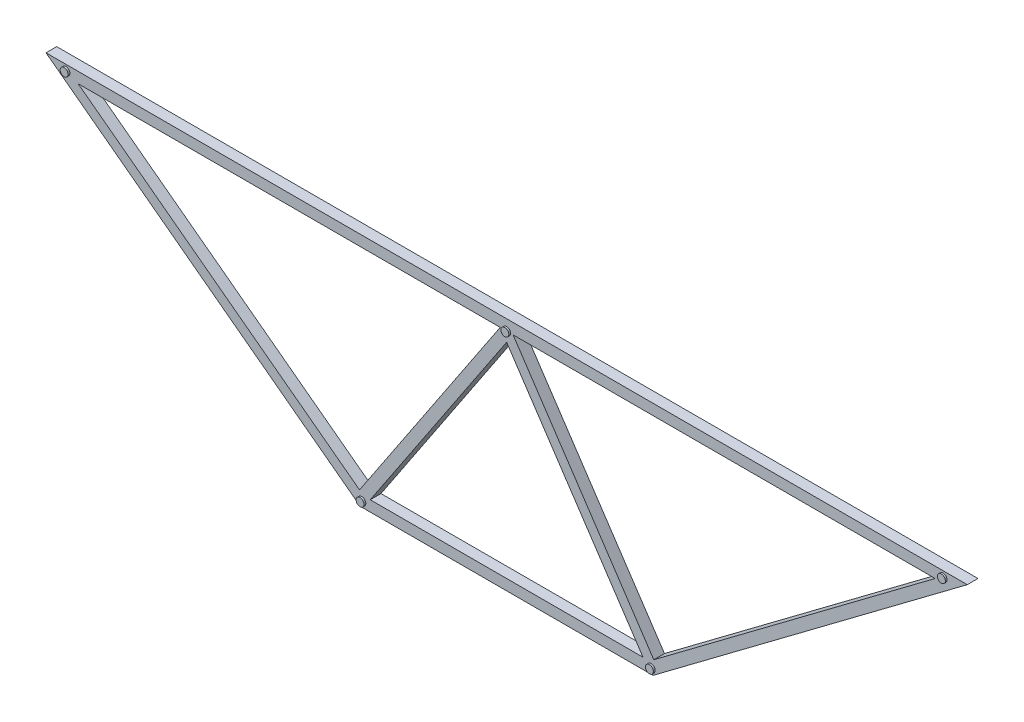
ISO-10303-21;
HEADER;
FILE_DESCRIPTION(('STEP AP214'),'2;1');
FILE_NAME('part.step','',(''),(''),'','','');
FILE_SCHEMA(('AUTOMOTIVE_DESIGN { 1 0 10303 214 1 1 1 1 }'));
ENDSEC;
DATA;
#1=APPLICATION_CONTEXT('core data for automotive mechanical design processes');
#2=APPLICATION_PROTOCOL_DEFINITION('international standard','automotive_design',2000,#1);
#3=PRODUCT_CONTEXT('',#1,'mechanical');
#4=PRODUCT('Part','Part','',(#3));
#5=PRODUCT_RELATED_PRODUCT_CATEGORY('part','',(#4));
#6=PRODUCT_DEFINITION_FORMATION('','',#4);
#7=PRODUCT_DEFINITION_CONTEXT('part definition',#1,'design');
#8=PRODUCT_DEFINITION('design','',#6,#7);
#9=PRODUCT_DEFINITION_SHAPE('','',#8);
#10=(LENGTH_UNIT() NAMED_UNIT(*) SI_UNIT(.MILLI.,.METRE.));
#11=(NAMED_UNIT(*) PLANE_ANGLE_UNIT() SI_UNIT($,.RADIAN.));
#12=(NAMED_UNIT(*) SI_UNIT($,.STERADIAN.) SOLID_ANGLE_UNIT());
#13=UNCERTAINTY_MEASURE_WITH_UNIT(LENGTH_MEASURE(1.E-05),#10,'distance_accuracy_value','');
#14=(GEOMETRIC_REPRESENTATION_CONTEXT(3) GLOBAL_UNCERTAINTY_ASSIGNED_CONTEXT((#13)) GLOBAL_UNIT_ASSIGNED_CONTEXT((#10,
#11,#12)) REPRESENTATION_CONTEXT('',''));
#15=CARTESIAN_POINT('',(0.,0.,0.));
#16=DIRECTION('',(0.,0.,1.));
#17=DIRECTION('',(1.,0.,0.));
#18=AXIS2_PLACEMENT_3D('',#15,#16,#17);
#19=CARTESIAN_POINT('',(600.,0.,17.5));
#20=DIRECTION('',(0.,0.,-1.));
#21=DIRECTION('',(-1.,0.,0.));
#22=AXIS2_PLACEMENT_3D('',#19,#20,#21);
#23=CYLINDRICAL_SURFACE('',#22,5.55499999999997);
#24=CARTESIAN_POINT('',(600.,0.,17.5));
#25=DIRECTION('',(0.,0.,1.));
#26=DIRECTION('',(1.,0.,0.));
#27=AXIS2_PLACEMENT_3D('',#24,#25,#26);
#28=CIRCLE('',#27,5.55499999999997);
#29=CARTESIAN_POINT('',(605.555,0.,17.5));
#30=VERTEX_POINT('',#29);
#31=EDGE_CURVE('E61',#30,#30,#28,.T.);
#32=ORIENTED_EDGE('',*,*,#31,.F.);
#33=EDGE_LOOP('',(#32));
#34=FACE_BOUND('',#33,.T.);
#35=CARTESIAN_POINT('',(600.,0.,-2.5));
#36=DIRECTION('',(0.,0.,1.));
#37=DIRECTION('',(1.,0.,0.));
#38=AXIS2_PLACEMENT_3D('',#35,#36,#37);
#39=CIRCLE('',#38,5.55499999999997);
#40=CARTESIAN_POINT('',(605.555,0.,-2.5));
#41=VERTEX_POINT('',#40);
#42=EDGE_CURVE('E11',#41,#41,#39,.T.);
#43=ORIENTED_EDGE('',*,*,#42,.T.);
#44=EDGE_LOOP('',(#43));
#45=FACE_BOUND('',#44,.T.);
#46=ADVANCED_FACE('F59',(#34,#45),#23,.T.);
#47=CARTESIAN_POINT('',(600.,0.,17.5));
#48=DIRECTION('',(0.,0.,1.));
#49=DIRECTION('',(1.,0.,0.));
#50=AXIS2_PLACEMENT_3D('',#47,#48,#49);
#51=PLANE('',#50);
#52=ORIENTED_EDGE('',*,*,#31,.T.);
#53=EDGE_LOOP('',(#52));
#54=FACE_BOUND('',#53,.T.);
#55=ADVANCED_FACE('F72',(#54),#51,.T.);
#56=CARTESIAN_POINT('',(600.,0.,-2.5));
#57=DIRECTION('',(0.,0.,1.));
#58=DIRECTION('',(1.,0.,0.));
#59=AXIS2_PLACEMENT_3D('',#56,#57,#58);
#60=PLANE('',#59);
#61=ORIENTED_EDGE('',*,*,#42,.F.);
#62=EDGE_LOOP('',(#61));
#63=FACE_BOUND('',#62,.T.);
#64=ADVANCED_FACE('F58',(#63),#60,.F.);
#65=CLOSED_SHELL('',(#46,#55,#64));
#66=MANIFOLD_SOLID_BREP('B2',#65);
#67=CARTESIAN_POINT('',(1211.20734908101,6.71276008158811,17.5));
#68=DIRECTION('',(0.,0.,-1.));
#69=DIRECTION('',(-1.,0.,0.));
#70=AXIS2_PLACEMENT_3D('',#67,#68,#69);
#71=CYLINDRICAL_SURFACE('',#70,5.55499999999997);
#72=CARTESIAN_POINT('',(1211.20734908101,6.71276008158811,17.5));
#73=DIRECTION('',(0.,0.,1.));
#74=DIRECTION('',(1.,0.,0.));
#75=AXIS2_PLACEMENT_3D('',#72,#73,#74);
#76=CIRCLE('',#75,5.55499999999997);
#77=CARTESIAN_POINT('',(1216.76234908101,6.71276008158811,17.5));
#78=VERTEX_POINT('',#77);
#79=EDGE_CURVE('E117',#78,#78,#76,.T.);
#80=ORIENTED_EDGE('',*,*,#79,.F.);
#81=EDGE_LOOP('',(#80));
#82=FACE_BOUND('',#81,.T.);
#83=CARTESIAN_POINT('',(1211.20734908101,6.71276008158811,-2.5));
#84=DIRECTION('',(0.,0.,1.));
#85=DIRECTION('',(1.,0.,0.));
#86=AXIS2_PLACEMENT_3D('',#83,#84,#85);
#87=CIRCLE('',#86,5.55499999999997);
#88=CARTESIAN_POINT('',(1216.76234908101,6.71276008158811,-2.5));
#89=VERTEX_POINT('',#88);
#90=EDGE_CURVE('E60',#89,#89,#87,.T.);
#91=ORIENTED_EDGE('',*,*,#90,.T.);
#92=EDGE_LOOP('',(#91));
#93=FACE_BOUND('',#92,.T.);
#94=ADVANCED_FACE('F108',(#82,#93),#71,.T.);
#95=CARTESIAN_POINT('',(1211.20734908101,6.71276008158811,17.5));
#96=DIRECTION('',(0.,0.,1.));
#97=DIRECTION('',(1.,0.,0.));
#98=AXIS2_PLACEMENT_3D('',#95,#96,#97);
#99=PLANE('',#98);
#100=ORIENTED_EDGE('',*,*,#79,.T.);
#101=EDGE_LOOP('',(#100));
#102=FACE_BOUND('',#101,.T.);
#103=ADVANCED_FACE('F125',(#102),#99,.T.);
#104=CARTESIAN_POINT('',(1211.20734908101,6.71276008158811,-2.5));
#105=DIRECTION('',(0.,0.,1.));
#106=DIRECTION('',(1.,0.,0.));
#107=AXIS2_PLACEMENT_3D('',#104,#105,#106);
#108=PLANE('',#107);
#109=ORIENTED_EDGE('',*,*,#90,.F.);
#110=EDGE_LOOP('',(#109));
#111=FACE_BOUND('',#110,.T.);
#112=ADVANCED_FACE('F112',(#111),#108,.F.);
#113=CLOSED_SHELL('',(#94,#103,#112));
#114=MANIFOLD_SOLID_BREP('B6',#113);
#115=CARTESIAN_POINT('',(802.394900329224,-307.553177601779,17.5));
#116=DIRECTION('',(0.,0.,-1.));
#117=DIRECTION('',(-1.,0.,0.));
#118=AXIS2_PLACEMENT_3D('',#115,#116,#117);
#119=CYLINDRICAL_SURFACE('',#118,5.55499999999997);
#120=CARTESIAN_POINT('',(802.394900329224,-307.553177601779,17.5));
#121=DIRECTION('',(0.,0.,1.));
#122=DIRECTION('',(1.,0.,0.));
#123=AXIS2_PLACEMENT_3D('',#120,#121,#122);
#124=CIRCLE('',#123,5.55499999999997);
#125=CARTESIAN_POINT('',(807.949900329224,-307.553177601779,17.5));
#126=VERTEX_POINT('',#125);
#127=EDGE_CURVE('E170',#126,#126,#124,.T.);
#128=ORIENTED_EDGE('',*,*,#127,.F.);
#129=EDGE_LOOP('',(#128));
#130=FACE_BOUND('',#129,.T.);
#131=CARTESIAN_POINT('',(802.394900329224,-307.553177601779,-2.5));
#132=DIRECTION('',(0.,0.,1.));
#133=DIRECTION('',(1.,0.,0.));
#134=AXIS2_PLACEMENT_3D('',#131,#132,#133);
#135=CIRCLE('',#134,5.55499999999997);
#136=CARTESIAN_POINT('',(807.949900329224,-307.553177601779,-2.5));
#137=VERTEX_POINT('',#136);
#138=EDGE_CURVE('E107',#137,#137,#135,.T.);
#139=ORIENTED_EDGE('',*,*,#138,.T.);
#140=EDGE_LOOP('',(#139));
#141=FACE_BOUND('',#140,.T.);
#142=ADVANCED_FACE('F159',(#130,#141),#119,.T.);
#143=CARTESIAN_POINT('',(802.394900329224,-307.553177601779,17.5));
#144=DIRECTION('',(0.,0.,1.));
#145=DIRECTION('',(1.,0.,0.));
#146=AXIS2_PLACEMENT_3D('',#143,#144,#145);
#147=PLANE('',#146);
#148=ORIENTED_EDGE('',*,*,#127,.T.);
#149=EDGE_LOOP('',(#148));
#150=FACE_BOUND('',#149,.T.);
#151=ADVANCED_FACE('F173',(#150),#147,.T.);
#152=CARTESIAN_POINT('',(802.394900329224,-307.553177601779,-2.5));
#153=DIRECTION('',(0.,0.,1.));
#154=DIRECTION('',(1.,0.,0.));
#155=AXIS2_PLACEMENT_3D('',#152,#153,#154);
#156=PLANE('',#155);
#157=ORIENTED_EDGE('',*,*,#138,.F.);
#158=EDGE_LOOP('',(#157));
#159=FACE_BOUND('',#158,.T.);
#160=ADVANCED_FACE('F165',(#159),#156,.F.);
#161=CLOSED_SHELL('',(#142,#151,#160));
#162=MANIFOLD_SOLID_BREP('B55',#161);
#163=CARTESIAN_POINT('',(397.256799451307,-307.553177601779,17.5));
#164=DIRECTION('',(0.,0.,-1.));
#165=DIRECTION('',(-1.,0.,0.));
#166=AXIS2_PLACEMENT_3D('',#163,#164,#165);
#167=CYLINDRICAL_SURFACE('',#166,5.55499999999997);
#168=CARTESIAN_POINT('',(397.256799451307,-307.553177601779,17.5));
#169=DIRECTION('',(0.,0.,1.));
#170=DIRECTION('',(1.,0.,0.));
#171=AXIS2_PLACEMENT_3D('',#168,#169,#170);
#172=CIRCLE('',#171,5.55499999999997);
#173=CARTESIAN_POINT('',(402.811799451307,-307.553177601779,17.5));
#174=VERTEX_POINT('',#173);
#175=EDGE_CURVE('E217',#174,#174,#172,.T.);
#176=ORIENTED_EDGE('',*,*,#175,.F.);
#177=EDGE_LOOP('',(#176));
#178=FACE_BOUND('',#177,.T.);
#179=CARTESIAN_POINT('',(397.256799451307,-307.553177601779,-2.5));
#180=DIRECTION('',(0.,0.,1.));
#181=DIRECTION('',(1.,0.,0.));
#182=AXIS2_PLACEMENT_3D('',#179,#180,#181);
#183=CIRCLE('',#182,5.55499999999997);
#184=CARTESIAN_POINT('',(402.811799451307,-307.553177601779,-2.5));
#185=VERTEX_POINT('',#184);
#186=EDGE_CURVE('E157',#185,#185,#183,.T.);
#187=ORIENTED_EDGE('',*,*,#186,.T.);
#188=EDGE_LOOP('',(#187));
#189=FACE_BOUND('',#188,.T.);
#190=ADVANCED_FACE('F211',(#178,#189),#167,.T.);
#191=CARTESIAN_POINT('',(397.256799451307,-307.553177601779,17.5));
#192=DIRECTION('',(0.,0.,1.));
#193=DIRECTION('',(1.,0.,0.));
#194=AXIS2_PLACEMENT_3D('',#191,#192,#193);
#195=PLANE('',#194);
#196=ORIENTED_EDGE('',*,*,#175,.T.);
#197=EDGE_LOOP('',(#196));
#198=FACE_BOUND('',#197,.T.);
#199=ADVANCED_FACE('F221',(#198),#195,.T.);
#200=CARTESIAN_POINT('',(397.256799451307,-307.553177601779,-2.5));
#201=DIRECTION('',(0.,0.,1.));
#202=DIRECTION('',(1.,0.,0.));
#203=AXIS2_PLACEMENT_3D('',#200,#201,#202);
#204=PLANE('',#203);
#205=ORIENTED_EDGE('',*,*,#186,.F.);
#206=EDGE_LOOP('',(#205));
#207=FACE_BOUND('',#206,.T.);
#208=ADVANCED_FACE('F213',(#207),#204,.F.);
#209=CLOSED_SHELL('',(#190,#199,#208));
#210=MANIFOLD_SOLID_BREP('B103',#209);
#211=CARTESIAN_POINT('',(-17.1152394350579,6.71276008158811,17.5));
#212=DIRECTION('',(0.,0.,-1.));
#213=DIRECTION('',(-1.,0.,0.));
#214=AXIS2_PLACEMENT_3D('',#211,#212,#213);
#215=CYLINDRICAL_SURFACE('',#214,5.555);
#216=CARTESIAN_POINT('',(-17.1152394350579,6.71276008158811,17.5));
#217=DIRECTION('',(0.,0.,1.));
#218=DIRECTION('',(1.,0.,0.));
#219=AXIS2_PLACEMENT_3D('',#216,#217,#218);
#220=CIRCLE('',#219,5.555);
#221=CARTESIAN_POINT('',(-11.5602394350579,6.71276008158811,17.5));
#222=VERTEX_POINT('',#221);
#223=EDGE_CURVE('E209',#222,#222,#220,.T.);
#224=ORIENTED_EDGE('',*,*,#223,.F.);
#225=EDGE_LOOP('',(#224));
#226=FACE_BOUND('',#225,.T.);
#227=CARTESIAN_POINT('',(-17.1152394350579,6.71276008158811,-2.5));
#228=DIRECTION('',(0.,0.,1.));
#229=DIRECTION('',(1.,0.,0.));
#230=AXIS2_PLACEMENT_3D('',#227,#228,#229);
#231=CIRCLE('',#230,5.555);
#232=CARTESIAN_POINT('',(-11.5602394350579,6.71276008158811,-2.5));
#233=VERTEX_POINT('',#232);
#234=EDGE_CURVE('E267',#233,#233,#231,.T.);
#235=ORIENTED_EDGE('',*,*,#234,.T.);
#236=EDGE_LOOP('',(#235));
#237=FACE_BOUND('',#236,.T.);
#238=ADVANCED_FACE('F263',(#226,#237),#215,.T.);
#239=CARTESIAN_POINT('',(-17.1152394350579,6.71276008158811,17.5));
#240=DIRECTION('',(0.,0.,1.));
#241=DIRECTION('',(1.,0.,0.));
#242=AXIS2_PLACEMENT_3D('',#239,#240,#241);
#243=PLANE('',#242);
#244=ORIENTED_EDGE('',*,*,#223,.T.);
#245=EDGE_LOOP('',(#244));
#246=FACE_BOUND('',#245,.T.);
#247=ADVANCED_FACE('F279',(#246),#243,.T.);
#248=CARTESIAN_POINT('',(-17.1152394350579,6.71276008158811,-2.5));
#249=DIRECTION('',(0.,0.,1.));
#250=DIRECTION('',(1.,0.,0.));
#251=AXIS2_PLACEMENT_3D('',#248,#249,#250);
#252=PLANE('',#251);
#253=ORIENTED_EDGE('',*,*,#234,.F.);
#254=EDGE_LOOP('',(#253));
#255=FACE_BOUND('',#254,.T.);
#256=ADVANCED_FACE('F277',(#255),#252,.F.);
#257=CLOSED_SHELL('',(#238,#247,#256));
#258=MANIFOLD_SOLID_BREP('B152',#257);
#259=CARTESIAN_POINT('',(-9.00000000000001,-12.,15.));
#260=DIRECTION('',(0.6,0.8,0.));
#261=DIRECTION('',(-0.8,0.6,0.));
#262=AXIS2_PLACEMENT_3D('',#259,#260,#261);
#263=PLANE('',#262);
#264=DIRECTION('',(0.8,-0.6,0.));
#265=VECTOR('',#264,1.);
#266=CARTESIAN_POINT('',(-9.00000000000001,-12.,0.));
#267=LINE('',#266,#265);
#268=CARTESIAN_POINT('',(-45.,15.,0.));
#269=VERTEX_POINT('',#268);
#270=CARTESIAN_POINT('',(395.,-315.,0.));
#271=VERTEX_POINT('',#270);
#272=EDGE_CURVE('E460',#269,#271,#267,.T.);
#273=ORIENTED_EDGE('',*,*,#272,.T.);
#274=DIRECTION('',(0.,0.,-1.));
#275=VECTOR('',#274,1.);
#276=CARTESIAN_POINT('',(395.,-315.,15.));
#277=LINE('',#276,#275);
#278=CARTESIAN_POINT('',(395.,-315.,15.));
#279=VERTEX_POINT('',#278);
#280=EDGE_CURVE('E261',#279,#271,#277,.T.);
#281=ORIENTED_EDGE('',*,*,#280,.F.);
#282=DIRECTION('',(0.8,-0.6,0.));
#283=VECTOR('',#282,1.);
#284=CARTESIAN_POINT('',(-9.00000000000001,-12.,15.));
#285=LINE('',#284,#283);
#286=CARTESIAN_POINT('',(-45.,15.,15.));
#287=VERTEX_POINT('',#286);
#288=EDGE_CURVE('E411',#287,#279,#285,.T.);
#289=ORIENTED_EDGE('',*,*,#288,.F.);
#290=DIRECTION('',(0.,0.,-1.));
#291=VECTOR('',#290,1.);
#292=CARTESIAN_POINT('',(-45.,15.,15.));
#293=LINE('',#292,#291);
#294=EDGE_CURVE('E324',#287,#269,#293,.T.);
#295=ORIENTED_EDGE('',*,*,#294,.T.);
#296=EDGE_LOOP('',(#273,#281,#289,#295));
#297=FACE_BOUND('',#296,.T.);
#298=ADVANCED_FACE('F308',(#297),#263,.F.);
#299=CARTESIAN_POINT('',(0.,-315.,15.));
#300=DIRECTION('',(0.,1.,0.));
#301=DIRECTION('',(-1.,0.,0.));
#302=AXIS2_PLACEMENT_3D('',#299,#300,#301);
#303=PLANE('',#302);
#304=DIRECTION('',(1.,0.,0.));
#305=VECTOR('',#304,1.);
#306=CARTESIAN_POINT('',(0.,-315.,0.));
#307=LINE('',#306,#305);
#308=CARTESIAN_POINT('',(805.,-315.,0.));
#309=VERTEX_POINT('',#308);
#310=EDGE_CURVE('E423',#271,#309,#307,.T.);
#311=ORIENTED_EDGE('',*,*,#310,.T.);
#312=DIRECTION('',(0.,0.,-1.));
#313=VECTOR('',#312,1.);
#314=CARTESIAN_POINT('',(805.,-315.,15.));
#315=LINE('',#314,#313);
#316=CARTESIAN_POINT('',(805.,-315.,15.));
#317=VERTEX_POINT('',#316);
#318=EDGE_CURVE('E316',#317,#309,#315,.T.);
#319=ORIENTED_EDGE('',*,*,#318,.F.);
#320=DIRECTION('',(1.,0.,0.));
#321=VECTOR('',#320,1.);
#322=CARTESIAN_POINT('',(0.,-315.,15.));
#323=LINE('',#322,#321);
#324=EDGE_CURVE('E409',#279,#317,#323,.T.);
#325=ORIENTED_EDGE('',*,*,#324,.F.);
#326=ORIENTED_EDGE('',*,*,#280,.T.);
#327=EDGE_LOOP('',(#311,#319,#325,#326));
#328=FACE_BOUND('',#327,.T.);
#329=ADVANCED_FACE('F419',(#328),#303,.F.);
#330=CARTESIAN_POINT('',(441.,-588.,15.));
#331=DIRECTION('',(0.6,-0.8,0.));
#332=DIRECTION('',(0.8,0.6,0.));
#333=AXIS2_PLACEMENT_3D('',#330,#331,#332);
#334=PLANE('',#333);
#335=DIRECTION('',(-0.8,-0.6,0.));
#336=VECTOR('',#335,1.);
#337=CARTESIAN_POINT('',(441.,-588.,0.));
#338=LINE('',#337,#336);
#339=CARTESIAN_POINT('',(1245.,15.,0.));
#340=VERTEX_POINT('',#339);
#341=EDGE_CURVE('E458',#340,#309,#338,.T.);
#342=ORIENTED_EDGE('',*,*,#341,.F.);
#343=DIRECTION('',(0.,0.,-1.));
#344=VECTOR('',#343,1.);
#345=CARTESIAN_POINT('',(1245.,15.,15.));
#346=LINE('',#345,#344);
#347=CARTESIAN_POINT('',(1245.,15.,15.));
#348=VERTEX_POINT('',#347);
#349=EDGE_CURVE('E368',#348,#340,#346,.T.);
#350=ORIENTED_EDGE('',*,*,#349,.F.);
#351=DIRECTION('',(-0.8,-0.6,0.));
#352=VECTOR('',#351,1.);
#353=CARTESIAN_POINT('',(441.,-588.,15.));
#354=LINE('',#353,#352);
#355=EDGE_CURVE('E414',#348,#317,#354,.T.);
#356=ORIENTED_EDGE('',*,*,#355,.T.);
#357=ORIENTED_EDGE('',*,*,#318,.T.);
#358=EDGE_LOOP('',(#342,#350,#356,#357));
#359=FACE_BOUND('',#358,.T.);
#360=ADVANCED_FACE('F422',(#359),#334,.T.);
#361=CARTESIAN_POINT('',(0.,0.,15.));
#362=DIRECTION('',(0.,1.,0.));
#363=DIRECTION('',(0.,0.,1.));
#364=AXIS2_PLACEMENT_3D('',#361,#362,#363);
#365=PLANE('',#364);
#366=DIRECTION('',(1.,0.,0.));
#367=VECTOR('',#366,1.);
#368=CARTESIAN_POINT('',(0.,0.,0.));
#369=LINE('',#368,#367);
#370=CARTESIAN_POINT('',(0.,0.,0.));
#371=VERTEX_POINT('',#370);
#372=CARTESIAN_POINT('',(590.98612181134,0.,0.));
#373=VERTEX_POINT('',#372);
#374=EDGE_CURVE('E438',#371,#373,#369,.T.);
#375=ORIENTED_EDGE('',*,*,#374,.T.);
#376=DIRECTION('',(0.,0.,-1.));
#377=VECTOR('',#376,1.);
#378=CARTESIAN_POINT('',(590.98612181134,0.,15.));
#379=LINE('',#378,#377);
#380=CARTESIAN_POINT('',(590.98612181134,0.,15.));
#381=VERTEX_POINT('',#380);
#382=EDGE_CURVE('E470',#381,#373,#379,.T.);
#383=ORIENTED_EDGE('',*,*,#382,.F.);
#384=DIRECTION('',(1.,0.,0.));
#385=VECTOR('',#384,1.);
#386=CARTESIAN_POINT('',(0.,0.,15.));
#387=LINE('',#386,#385);
#388=CARTESIAN_POINT('',(0.,0.,15.));
#389=VERTEX_POINT('',#388);
#390=EDGE_CURVE('E552',#389,#381,#387,.T.);
#391=ORIENTED_EDGE('',*,*,#390,.F.);
#392=DIRECTION('',(0.,0.,-1.));
#393=VECTOR('',#392,1.);
#394=CARTESIAN_POINT('',(0.,0.,15.));
#395=LINE('',#394,#393);
#396=EDGE_CURVE('E469',#389,#371,#395,.T.);
#397=ORIENTED_EDGE('',*,*,#396,.T.);
#398=EDGE_LOOP('',(#375,#383,#391,#397));
#399=FACE_BOUND('',#398,.T.);
#400=ADVANCED_FACE('F528',(#399),#365,.F.);
#401=CARTESIAN_POINT('',(409.144238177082,-272.762825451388,15.));
#402=DIRECTION('',(0.832050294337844,-0.554700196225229,0.));
#403=DIRECTION('',(0.554700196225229,0.832050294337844,0.));
#404=AXIS2_PLACEMENT_3D('',#401,#402,#403);
#405=PLANE('',#404);
#406=DIRECTION('',(-0.554700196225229,-0.832050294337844,0.));
#407=VECTOR('',#406,1.);
#408=CARTESIAN_POINT('',(409.144238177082,-272.762825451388,0.));
#409=LINE('',#408,#407);
#410=CARTESIAN_POINT('',(393.990747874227,-295.49306090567,0.));
#411=VERTEX_POINT('',#410);
#412=EDGE_CURVE('E452',#373,#411,#409,.T.);
#413=ORIENTED_EDGE('',*,*,#412,.T.);
#414=DIRECTION('',(0.,0.,-1.));
#415=VECTOR('',#414,1.);
#416=CARTESIAN_POINT('',(393.990747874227,-295.49306090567,15.));
#417=LINE('',#416,#415);
#418=CARTESIAN_POINT('',(393.990747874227,-295.49306090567,15.));
#419=VERTEX_POINT('',#418);
#420=EDGE_CURVE('E473',#419,#411,#417,.T.);
#421=ORIENTED_EDGE('',*,*,#420,.F.);
#422=DIRECTION('',(-0.554700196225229,-0.832050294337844,0.));
#423=VECTOR('',#422,1.);
#424=CARTESIAN_POINT('',(409.144238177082,-272.762825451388,15.));
#425=LINE('',#424,#423);
#426=EDGE_CURVE('E560',#381,#419,#425,.T.);
#427=ORIENTED_EDGE('',*,*,#426,.F.);
#428=ORIENTED_EDGE('',*,*,#382,.T.);
#429=EDGE_LOOP('',(#413,#421,#427,#428));
#430=FACE_BOUND('',#429,.T.);
#431=ADVANCED_FACE('F525',(#430),#405,.F.);
#432=CARTESIAN_POINT('',(0.,-300.,15.));
#433=DIRECTION('',(0.,1.,0.));
#434=DIRECTION('',(0.,0.,1.));
#435=AXIS2_PLACEMENT_3D('',#432,#433,#434);
#436=PLANE('',#435);
#437=DIRECTION('',(1.,0.,0.));
#438=VECTOR('',#437,1.);
#439=CARTESIAN_POINT('',(0.,-300.,0.));
#440=LINE('',#439,#438);
#441=CARTESIAN_POINT('',(409.01387818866,-300.,0.));
#442=VERTEX_POINT('',#441);
#443=CARTESIAN_POINT('',(790.98612181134,-300.,0.));
#444=VERTEX_POINT('',#443);
#445=EDGE_CURVE('E445',#442,#444,#440,.T.);
#446=ORIENTED_EDGE('',*,*,#445,.F.);
#447=DIRECTION('',(0.,0.,-1.));
#448=VECTOR('',#447,1.);
#449=CARTESIAN_POINT('',(409.01387818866,-300.,15.));
#450=LINE('',#449,#448);
#451=CARTESIAN_POINT('',(409.01387818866,-300.,15.));
#452=VERTEX_POINT('',#451);
#453=EDGE_CURVE('E472',#452,#442,#450,.T.);
#454=ORIENTED_EDGE('',*,*,#453,.F.);
#455=DIRECTION('',(1.,0.,0.));
#456=VECTOR('',#455,1.);
#457=CARTESIAN_POINT('',(0.,-300.,15.));
#458=LINE('',#457,#456);
#459=CARTESIAN_POINT('',(790.98612181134,-300.,15.));
#460=VERTEX_POINT('',#459);
#461=EDGE_CURVE('E548',#452,#460,#458,.T.);
#462=ORIENTED_EDGE('',*,*,#461,.T.);
#463=DIRECTION('',(0.,0.,-1.));
#464=VECTOR('',#463,1.);
#465=CARTESIAN_POINT('',(790.98612181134,-300.,15.));
#466=LINE('',#465,#464);
#467=EDGE_CURVE('E478',#460,#444,#466,.T.);
#468=ORIENTED_EDGE('',*,*,#467,.T.);
#469=EDGE_LOOP('',(#446,#454,#462,#468));
#470=FACE_BOUND('',#469,.T.);
#471=ADVANCED_FACE('F521',(#470),#436,.T.);
#472=CARTESIAN_POINT('',(421.624992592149,-281.083328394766,15.));
#473=DIRECTION('',(0.832050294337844,-0.554700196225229,0.));
#474=DIRECTION('',(0.554700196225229,0.832050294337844,0.));
#475=AXIS2_PLACEMENT_3D('',#472,#473,#474);
#476=PLANE('',#475);
#477=DIRECTION('',(-0.554700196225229,-0.832050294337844,0.));
#478=VECTOR('',#477,1.);
#479=CARTESIAN_POINT('',(421.624992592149,-281.083328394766,0.));
#480=LINE('',#479,#478);
#481=CARTESIAN_POINT('',(600.,-13.5208172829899,0.));
#482=VERTEX_POINT('',#481);
#483=EDGE_CURVE('E443',#482,#442,#480,.T.);
#484=ORIENTED_EDGE('',*,*,#483,.F.);
#485=DIRECTION('',(0.,0.,-1.));
#486=VECTOR('',#485,1.);
#487=CARTESIAN_POINT('',(600.,-13.5208172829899,15.));
#488=LINE('',#487,#486);
#489=CARTESIAN_POINT('',(600.,-13.5208172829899,15.));
#490=VERTEX_POINT('',#489);
#491=EDGE_CURVE('E476',#490,#482,#488,.T.);
#492=ORIENTED_EDGE('',*,*,#491,.F.);
#493=DIRECTION('',(-0.554700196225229,-0.832050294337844,0.));
#494=VECTOR('',#493,1.);
#495=CARTESIAN_POINT('',(421.624992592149,-281.083328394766,15.));
#496=LINE('',#495,#494);
#497=EDGE_CURVE('E546',#490,#452,#496,.T.);
#498=ORIENTED_EDGE('',*,*,#497,.T.);
#499=ORIENTED_EDGE('',*,*,#453,.T.);
#500=EDGE_LOOP('',(#484,#492,#498,#499));
#501=FACE_BOUND('',#500,.T.);
#502=ADVANCED_FACE('F529',(#501),#476,.T.);
#503=CARTESIAN_POINT('',(421.624992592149,281.083328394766,15.));
#504=DIRECTION('',(0.832050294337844,0.554700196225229,0.));
#505=DIRECTION('',(-0.554700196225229,0.832050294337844,0.));
#506=AXIS2_PLACEMENT_3D('',#503,#504,#505);
#507=PLANE('',#506);
#508=DIRECTION('',(0.554700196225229,-0.832050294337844,0.));
#509=VECTOR('',#508,1.);
#510=CARTESIAN_POINT('',(421.624992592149,281.083328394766,0.));
#511=LINE('',#510,#509);
#512=CARTESIAN_POINT('',(609.01387818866,0.,0.));
#513=VERTEX_POINT('',#512);
#514=CARTESIAN_POINT('',(806.009252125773,-295.49306090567,0.));
#515=VERTEX_POINT('',#514);
#516=EDGE_CURVE('E435',#513,#515,#511,.T.);
#517=ORIENTED_EDGE('',*,*,#516,.F.);
#518=DIRECTION('',(0.,0.,-1.));
#519=VECTOR('',#518,1.);
#520=CARTESIAN_POINT('',(609.01387818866,0.,15.));
#521=LINE('',#520,#519);
#522=CARTESIAN_POINT('',(609.01387818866,0.,15.));
#523=VERTEX_POINT('',#522);
#524=EDGE_CURVE('E309',#523,#513,#521,.T.);
#525=ORIENTED_EDGE('',*,*,#524,.F.);
#526=DIRECTION('',(0.554700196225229,-0.832050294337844,0.));
#527=VECTOR('',#526,1.);
#528=CARTESIAN_POINT('',(421.624992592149,281.083328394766,15.));
#529=LINE('',#528,#527);
#530=CARTESIAN_POINT('',(806.009252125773,-295.49306090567,15.));
#531=VERTEX_POINT('',#530);
#532=EDGE_CURVE('E461',#523,#531,#529,.T.);
#533=ORIENTED_EDGE('',*,*,#532,.T.);
#534=DIRECTION('',(0.,0.,-1.));
#535=VECTOR('',#534,1.);
#536=CARTESIAN_POINT('',(806.009252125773,-295.49306090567,15.));
#537=LINE('',#536,#535);
#538=EDGE_CURVE('E428',#531,#515,#537,.T.);
#539=ORIENTED_EDGE('',*,*,#538,.T.);
#540=EDGE_LOOP('',(#517,#525,#533,#539));
#541=FACE_BOUND('',#540,.T.);
#542=ADVANCED_FACE('F306',(#541),#507,.T.);
#543=CARTESIAN_POINT('',(1200.,0.,0.));
#544=VERTEX_POINT('',#543);
#545=EDGE_CURVE('E434',#513,#544,#369,.T.);
#546=ORIENTED_EDGE('',*,*,#545,.T.);
#547=DIRECTION('',(0.,0.,-1.));
#548=VECTOR('',#547,1.);
#549=CARTESIAN_POINT('',(1200.,0.,15.));
#550=LINE('',#549,#548);
#551=CARTESIAN_POINT('',(1200.,0.,15.));
#552=VERTEX_POINT('',#551);
#553=EDGE_CURVE('E481',#552,#544,#550,.T.);
#554=ORIENTED_EDGE('',*,*,#553,.F.);
#555=EDGE_CURVE('E489',#523,#552,#387,.T.);
#556=ORIENTED_EDGE('',*,*,#555,.F.);
#557=ORIENTED_EDGE('',*,*,#524,.T.);
#558=EDGE_LOOP('',(#546,#554,#556,#557));
#559=FACE_BOUND('',#558,.T.);
#560=ADVANCED_FACE('F487',(#559),#365,.F.);
#561=CARTESIAN_POINT('',(0.,0.,15.));
#562=DIRECTION('',(0.6,0.8,0.));
#563=DIRECTION('',(-0.8,0.6,0.));
#564=AXIS2_PLACEMENT_3D('',#561,#562,#563);
#565=PLANE('',#564);
#566=DIRECTION('',(0.8,-0.6,0.));
#567=VECTOR('',#566,1.);
#568=CARTESIAN_POINT('',(0.,0.,0.));
#569=LINE('',#568,#567);
#570=EDGE_CURVE('E454',#371,#411,#569,.T.);
#571=ORIENTED_EDGE('',*,*,#570,.F.);
#572=ORIENTED_EDGE('',*,*,#396,.F.);
#573=DIRECTION('',(0.8,-0.6,0.));
#574=VECTOR('',#573,1.);
#575=CARTESIAN_POINT('',(0.,0.,15.));
#576=LINE('',#575,#574);
#577=EDGE_CURVE('E559',#389,#419,#576,.T.);
#578=ORIENTED_EDGE('',*,*,#577,.T.);
#579=ORIENTED_EDGE('',*,*,#420,.T.);
#580=EDGE_LOOP('',(#571,#572,#578,#579));
#581=FACE_BOUND('',#580,.T.);
#582=ADVANCED_FACE('F510',(#581),#565,.T.);
#583=CARTESIAN_POINT('',(409.144238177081,272.762825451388,15.));
#584=DIRECTION('',(0.832050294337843,0.55470019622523,0.));
#585=DIRECTION('',(-0.55470019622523,0.832050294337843,0.));
#586=AXIS2_PLACEMENT_3D('',#583,#584,#585);
#587=PLANE('',#586);
#588=DIRECTION('',(0.55470019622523,-0.832050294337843,0.));
#589=VECTOR('',#588,1.);
#590=CARTESIAN_POINT('',(409.144238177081,272.762825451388,0.));
#591=LINE('',#590,#589);
#592=EDGE_CURVE('E448',#482,#444,#591,.T.);
#593=ORIENTED_EDGE('',*,*,#592,.T.);
#594=ORIENTED_EDGE('',*,*,#467,.F.);
#595=DIRECTION('',(0.55470019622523,-0.832050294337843,0.));
#596=VECTOR('',#595,1.);
#597=CARTESIAN_POINT('',(409.144238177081,272.762825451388,15.));
#598=LINE('',#597,#596);
#599=EDGE_CURVE('E547',#490,#460,#598,.T.);
#600=ORIENTED_EDGE('',*,*,#599,.F.);
#601=ORIENTED_EDGE('',*,*,#491,.T.);
#602=EDGE_LOOP('',(#593,#594,#600,#601));
#603=FACE_BOUND('',#602,.T.);
#604=ADVANCED_FACE('F496',(#603),#587,.F.);
#605=CARTESIAN_POINT('',(432.,-576.,15.));
#606=DIRECTION('',(0.6,-0.8,0.));
#607=DIRECTION('',(0.8,0.6,0.));
#608=AXIS2_PLACEMENT_3D('',#605,#606,#607);
#609=PLANE('',#608);
#610=DIRECTION('',(-0.8,-0.6,0.));
#611=VECTOR('',#610,1.);
#612=CARTESIAN_POINT('',(432.,-576.,0.));
#613=LINE('',#612,#611);
#614=EDGE_CURVE('E437',#544,#515,#613,.T.);
#615=ORIENTED_EDGE('',*,*,#614,.T.);
#616=ORIENTED_EDGE('',*,*,#538,.F.);
#617=DIRECTION('',(-0.8,-0.6,0.));
#618=VECTOR('',#617,1.);
#619=CARTESIAN_POINT('',(432.,-576.,15.));
#620=LINE('',#619,#618);
#621=EDGE_CURVE('E554',#552,#531,#620,.T.);
#622=ORIENTED_EDGE('',*,*,#621,.F.);
#623=ORIENTED_EDGE('',*,*,#553,.T.);
#624=EDGE_LOOP('',(#615,#616,#622,#623));
#625=FACE_BOUND('',#624,.T.);
#626=ADVANCED_FACE('F497',(#625),#609,.F.);
#627=CARTESIAN_POINT('',(0.,15.,15.));
#628=DIRECTION('',(0.,1.,0.));
#629=DIRECTION('',(0.,0.,1.));
#630=AXIS2_PLACEMENT_3D('',#627,#628,#629);
#631=PLANE('',#630);
#632=DIRECTION('',(1.,0.,0.));
#633=VECTOR('',#632,1.);
#634=CARTESIAN_POINT('',(0.,15.,0.));
#635=LINE('',#634,#633);
#636=EDGE_CURVE('E465',#269,#340,#635,.T.);
#637=ORIENTED_EDGE('',*,*,#636,.F.);
#638=ORIENTED_EDGE('',*,*,#294,.F.);
#639=DIRECTION('',(1.,0.,0.));
#640=VECTOR('',#639,1.);
#641=CARTESIAN_POINT('',(0.,15.,15.));
#642=LINE('',#641,#640);
#643=EDGE_CURVE('E426',#287,#348,#642,.T.);
#644=ORIENTED_EDGE('',*,*,#643,.T.);
#645=ORIENTED_EDGE('',*,*,#349,.T.);
#646=EDGE_LOOP('',(#637,#638,#644,#645));
#647=FACE_BOUND('',#646,.T.);
#648=ADVANCED_FACE('F499',(#647),#631,.T.);
#649=CARTESIAN_POINT('',(0.,0.,15.));
#650=DIRECTION('',(0.,0.,1.));
#651=DIRECTION('',(1.,0.,0.));
#652=AXIS2_PLACEMENT_3D('',#649,#650,#651);
#653=PLANE('',#652);
#654=CARTESIAN_POINT('',(-17.1152394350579,6.71276008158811,15.));
#655=DIRECTION('',(0.,0.,1.));
#656=DIRECTION('',(1.,0.,0.));
#657=AXIS2_PLACEMENT_3D('',#654,#655,#656);
#658=CIRCLE('',#657,5.555);
#659=CARTESIAN_POINT('',(-11.5602394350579,6.71276008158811,15.));
#660=VERTEX_POINT('',#659);
#661=EDGE_CURVE('E597',#660,#660,#658,.T.);
#662=ORIENTED_EDGE('',*,*,#661,.F.);
#663=EDGE_LOOP('',(#662));
#664=FACE_BOUND('',#663,.T.);
#665=CARTESIAN_POINT('',(397.256799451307,-307.553177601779,15.));
#666=DIRECTION('',(0.,0.,1.));
#667=DIRECTION('',(1.,0.,0.));
#668=AXIS2_PLACEMENT_3D('',#665,#666,#667);
#669=CIRCLE('',#668,5.55499999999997);
#670=CARTESIAN_POINT('',(402.811799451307,-307.553177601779,15.));
#671=VERTEX_POINT('',#670);
#672=EDGE_CURVE('E596',#671,#671,#669,.T.);
#673=ORIENTED_EDGE('',*,*,#672,.F.);
#674=EDGE_LOOP('',(#673));
#675=FACE_BOUND('',#674,.T.);
#676=CARTESIAN_POINT('',(802.394900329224,-307.553177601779,15.));
#677=DIRECTION('',(0.,0.,1.));
#678=DIRECTION('',(1.,0.,0.));
#679=AXIS2_PLACEMENT_3D('',#676,#677,#678);
#680=CIRCLE('',#679,5.55499999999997);
#681=CARTESIAN_POINT('',(807.949900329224,-307.553177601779,15.));
#682=VERTEX_POINT('',#681);
#683=EDGE_CURVE('E587',#682,#682,#680,.T.);
#684=ORIENTED_EDGE('',*,*,#683,.F.);
#685=EDGE_LOOP('',(#684));
#686=FACE_BOUND('',#685,.T.);
#687=CARTESIAN_POINT('',(1211.20734908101,6.71276008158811,15.));
#688=DIRECTION('',(0.,0.,1.));
#689=DIRECTION('',(1.,0.,0.));
#690=AXIS2_PLACEMENT_3D('',#687,#688,#689);
#691=CIRCLE('',#690,5.55499999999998);
#692=CARTESIAN_POINT('',(1216.76234908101,6.71276008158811,15.));
#693=VERTEX_POINT('',#692);
#694=EDGE_CURVE('E585',#693,#693,#691,.T.);
#695=ORIENTED_EDGE('',*,*,#694,.F.);
#696=EDGE_LOOP('',(#695));
#697=FACE_BOUND('',#696,.T.);
#698=CARTESIAN_POINT('',(600.,0.,15.));
#699=DIRECTION('',(0.,0.,1.));
#700=DIRECTION('',(1.,0.,0.));
#701=AXIS2_PLACEMENT_3D('',#698,#699,#700);
#702=CIRCLE('',#701,5.55499999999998);
#703=CARTESIAN_POINT('',(605.555,0.,15.));
#704=VERTEX_POINT('',#703);
#705=EDGE_CURVE('E578',#704,#704,#702,.T.);
#706=ORIENTED_EDGE('',*,*,#705,.F.);
#707=EDGE_LOOP('',(#706));
#708=FACE_BOUND('',#707,.T.);
#709=ORIENTED_EDGE('',*,*,#532,.F.);
#710=ORIENTED_EDGE('',*,*,#555,.T.);
#711=ORIENTED_EDGE('',*,*,#621,.T.);
#712=EDGE_LOOP('',(#709,#710,#711));
#713=FACE_BOUND('',#712,.T.);
#714=ORIENTED_EDGE('',*,*,#461,.F.);
#715=ORIENTED_EDGE('',*,*,#497,.F.);
#716=ORIENTED_EDGE('',*,*,#599,.T.);
#717=EDGE_LOOP('',(#714,#715,#716));
#718=FACE_BOUND('',#717,.T.);
#719=ORIENTED_EDGE('',*,*,#390,.T.);
#720=ORIENTED_EDGE('',*,*,#426,.T.);
#721=ORIENTED_EDGE('',*,*,#577,.F.);
#722=EDGE_LOOP('',(#719,#720,#721));
#723=FACE_BOUND('',#722,.T.);
#724=ORIENTED_EDGE('',*,*,#288,.T.);
#725=ORIENTED_EDGE('',*,*,#324,.T.);
#726=ORIENTED_EDGE('',*,*,#355,.F.);
#727=ORIENTED_EDGE('',*,*,#643,.F.);
#728=EDGE_LOOP('',(#724,#725,#726,#727));
#729=FACE_BOUND('',#728,.T.);
#730=ADVANCED_FACE('F412',(#664,#675,#686,#697,#708,#713,#718,#723,#729),#653,.T.);
#731=CARTESIAN_POINT('',(0.,0.,0.));
#732=DIRECTION('',(0.,0.,1.));
#733=DIRECTION('',(1.,0.,0.));
#734=AXIS2_PLACEMENT_3D('',#731,#732,#733);
#735=PLANE('',#734);
#736=CARTESIAN_POINT('',(-17.1152394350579,6.71276008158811,0.));
#737=DIRECTION('',(0.,0.,1.));
#738=DIRECTION('',(1.,0.,0.));
#739=AXIS2_PLACEMENT_3D('',#736,#737,#738);
#740=CIRCLE('',#739,5.555);
#741=CARTESIAN_POINT('',(-11.5602394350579,6.71276008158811,0.));
#742=VERTEX_POINT('',#741);
#743=EDGE_CURVE('E436',#742,#742,#740,.T.);
#744=ORIENTED_EDGE('',*,*,#743,.T.);
#745=EDGE_LOOP('',(#744));
#746=FACE_BOUND('',#745,.T.);
#747=CARTESIAN_POINT('',(397.256799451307,-307.553177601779,0.));
#748=DIRECTION('',(0.,0.,1.));
#749=DIRECTION('',(1.,0.,0.));
#750=AXIS2_PLACEMENT_3D('',#747,#748,#749);
#751=CIRCLE('',#750,5.55499999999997);
#752=CARTESIAN_POINT('',(402.811799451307,-307.553177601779,0.));
#753=VERTEX_POINT('',#752);
#754=EDGE_CURVE('E593',#753,#753,#751,.T.);
#755=ORIENTED_EDGE('',*,*,#754,.T.);
#756=EDGE_LOOP('',(#755));
#757=FACE_BOUND('',#756,.T.);
#758=CARTESIAN_POINT('',(802.394900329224,-307.553177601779,0.));
#759=DIRECTION('',(0.,0.,1.));
#760=DIRECTION('',(1.,0.,0.));
#761=AXIS2_PLACEMENT_3D('',#758,#759,#760);
#762=CIRCLE('',#761,5.55499999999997);
#763=CARTESIAN_POINT('',(807.949900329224,-307.553177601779,0.));
#764=VERTEX_POINT('',#763);
#765=EDGE_CURVE('E590',#764,#764,#762,.T.);
#766=ORIENTED_EDGE('',*,*,#765,.T.);
#767=EDGE_LOOP('',(#766));
#768=FACE_BOUND('',#767,.T.);
#769=CARTESIAN_POINT('',(1211.20734908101,6.71276008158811,0.));
#770=DIRECTION('',(0.,0.,1.));
#771=DIRECTION('',(1.,0.,0.));
#772=AXIS2_PLACEMENT_3D('',#769,#770,#771);
#773=CIRCLE('',#772,5.55499999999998);
#774=CARTESIAN_POINT('',(1216.76234908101,6.71276008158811,0.));
#775=VERTEX_POINT('',#774);
#776=EDGE_CURVE('E583',#775,#775,#773,.T.);
#777=ORIENTED_EDGE('',*,*,#776,.T.);
#778=EDGE_LOOP('',(#777));
#779=FACE_BOUND('',#778,.T.);
#780=CARTESIAN_POINT('',(600.,0.,0.));
#781=DIRECTION('',(0.,0.,1.));
#782=DIRECTION('',(1.,0.,0.));
#783=AXIS2_PLACEMENT_3D('',#780,#781,#782);
#784=CIRCLE('',#783,5.55499999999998);
#785=CARTESIAN_POINT('',(605.555,0.,0.));
#786=VERTEX_POINT('',#785);
#787=EDGE_CURVE('E571',#786,#786,#784,.T.);
#788=ORIENTED_EDGE('',*,*,#787,.T.);
#789=EDGE_LOOP('',(#788));
#790=FACE_BOUND('',#789,.T.);
#791=ORIENTED_EDGE('',*,*,#516,.T.);
#792=ORIENTED_EDGE('',*,*,#614,.F.);
#793=ORIENTED_EDGE('',*,*,#545,.F.);
#794=EDGE_LOOP('',(#791,#792,#793));
#795=FACE_BOUND('',#794,.T.);
#796=ORIENTED_EDGE('',*,*,#445,.T.);
#797=ORIENTED_EDGE('',*,*,#592,.F.);
#798=ORIENTED_EDGE('',*,*,#483,.T.);
#799=EDGE_LOOP('',(#796,#797,#798));
#800=FACE_BOUND('',#799,.T.);
#801=ORIENTED_EDGE('',*,*,#374,.F.);
#802=ORIENTED_EDGE('',*,*,#570,.T.);
#803=ORIENTED_EDGE('',*,*,#412,.F.);
#804=EDGE_LOOP('',(#801,#802,#803));
#805=FACE_BOUND('',#804,.T.);
#806=ORIENTED_EDGE('',*,*,#272,.F.);
#807=ORIENTED_EDGE('',*,*,#636,.T.);
#808=ORIENTED_EDGE('',*,*,#341,.T.);
#809=ORIENTED_EDGE('',*,*,#310,.F.);
#810=EDGE_LOOP('',(#806,#807,#808,#809));
#811=FACE_BOUND('',#810,.T.);
#812=ADVANCED_FACE('F492',(#746,#757,#768,#779,#790,#795,#800,#805,#811),#735,.F.);
#813=CARTESIAN_POINT('',(600.,0.,0.));
#814=DIRECTION('',(0.,0.,1.));
#815=DIRECTION('',(1.,0.,0.));
#816=AXIS2_PLACEMENT_3D('',#813,#814,#815);
#817=CYLINDRICAL_SURFACE('',#816,5.55499999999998);
#818=ORIENTED_EDGE('',*,*,#787,.F.);
#819=EDGE_LOOP('',(#818));
#820=FACE_BOUND('',#819,.T.);
#821=ORIENTED_EDGE('',*,*,#705,.T.);
#822=EDGE_LOOP('',(#821));
#823=FACE_BOUND('',#822,.T.);
#824=ADVANCED_FACE('F623',(#820,#823),#817,.F.);
#825=CARTESIAN_POINT('',(1211.20734908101,6.71276008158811,0.));
#826=DIRECTION('',(0.,0.,1.));
#827=DIRECTION('',(1.,0.,0.));
#828=AXIS2_PLACEMENT_3D('',#825,#826,#827);
#829=CYLINDRICAL_SURFACE('',#828,5.55499999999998);
#830=ORIENTED_EDGE('',*,*,#776,.F.);
#831=EDGE_LOOP('',(#830));
#832=FACE_BOUND('',#831,.T.);
#833=ORIENTED_EDGE('',*,*,#694,.T.);
#834=EDGE_LOOP('',(#833));
#835=FACE_BOUND('',#834,.T.);
#836=ADVANCED_FACE('F630',(#832,#835),#829,.F.);
#837=CARTESIAN_POINT('',(802.394900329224,-307.553177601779,0.));
#838=DIRECTION('',(0.,0.,1.));
#839=DIRECTION('',(1.,0.,0.));
#840=AXIS2_PLACEMENT_3D('',#837,#838,#839);
#841=CYLINDRICAL_SURFACE('',#840,5.55499999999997);
#842=ORIENTED_EDGE('',*,*,#765,.F.);
#843=EDGE_LOOP('',(#842));
#844=FACE_BOUND('',#843,.T.);
#845=ORIENTED_EDGE('',*,*,#683,.T.);
#846=EDGE_LOOP('',(#845));
#847=FACE_BOUND('',#846,.T.);
#848=ADVANCED_FACE('F633',(#844,#847),#841,.F.);
#849=CARTESIAN_POINT('',(397.256799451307,-307.553177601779,0.));
#850=DIRECTION('',(0.,0.,1.));
#851=DIRECTION('',(1.,0.,0.));
#852=AXIS2_PLACEMENT_3D('',#849,#850,#851);
#853=CYLINDRICAL_SURFACE('',#852,5.55499999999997);
#854=ORIENTED_EDGE('',*,*,#754,.F.);
#855=EDGE_LOOP('',(#854));
#856=FACE_BOUND('',#855,.T.);
#857=ORIENTED_EDGE('',*,*,#672,.T.);
#858=EDGE_LOOP('',(#857));
#859=FACE_BOUND('',#858,.T.);
#860=ADVANCED_FACE('F608',(#856,#859),#853,.F.);
#861=CARTESIAN_POINT('',(-17.1152394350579,6.71276008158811,0.));
#862=DIRECTION('',(0.,0.,1.));
#863=DIRECTION('',(1.,0.,0.));
#864=AXIS2_PLACEMENT_3D('',#861,#862,#863);
#865=CYLINDRICAL_SURFACE('',#864,5.555);
#866=ORIENTED_EDGE('',*,*,#743,.F.);
#867=EDGE_LOOP('',(#866));
#868=FACE_BOUND('',#867,.T.);
#869=ORIENTED_EDGE('',*,*,#661,.T.);
#870=EDGE_LOOP('',(#869));
#871=FACE_BOUND('',#870,.T.);
#872=ADVANCED_FACE('F610',(#868,#871),#865,.F.);
#873=CLOSED_SHELL('',(#298,#329,#360,#400,#431,#471,#502,#542,#560,#582,#604,#626,#648,#730,
#812,#824,#836,#848,#860,#872));
#874=MANIFOLD_SOLID_BREP('B202',#873);
#875=ADVANCED_BREP_SHAPE_REPRESENTATION('',(#18,#66,#114,#162,#210,#258,#874),#14);
#876=SHAPE_DEFINITION_REPRESENTATION(#9,#875);
ENDSEC;
END-ISO-10303-21;
